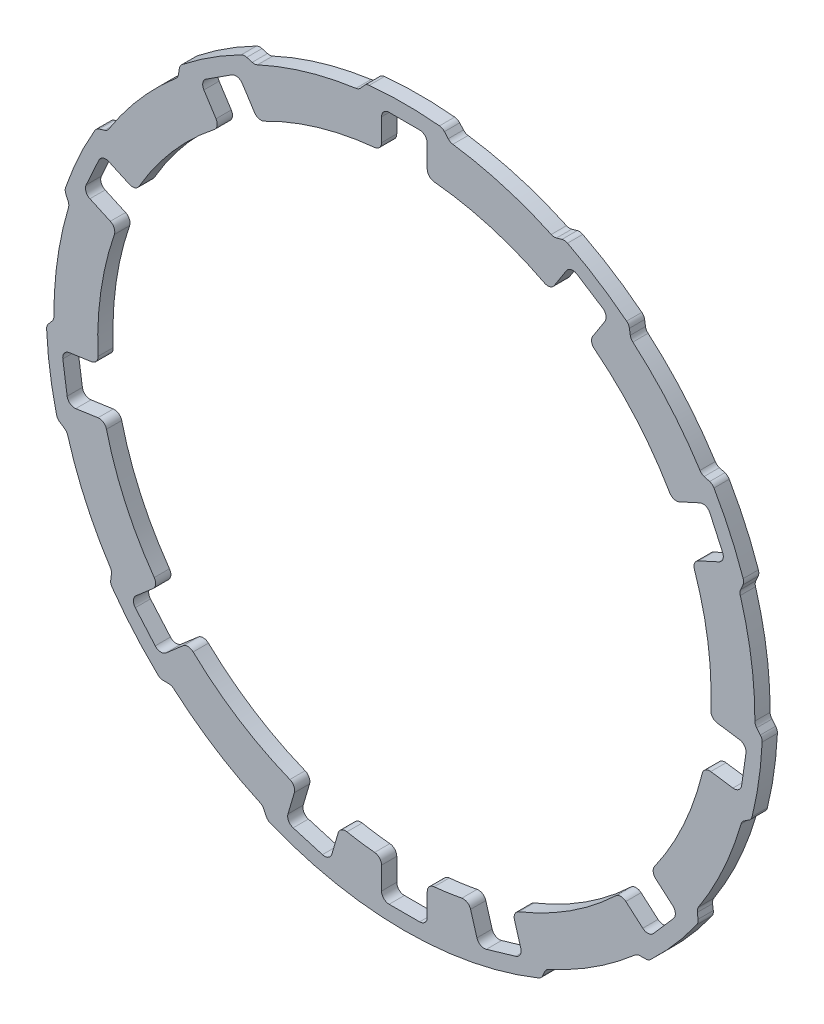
from build123d import *

# Parameters (mm, degrees)
ESQUISSE1_R                        = 46
ESQUISSE1_R_2                      = 40.25
EXTRUSION1_DEPTH                   = 2
EXTRUSION2_DEPTH                   = 2
ESQUISSE3_W                        = 6
ESQUISSE3_H                        = 45
ENL_V_MAT_EXTRU_1_DEPTH            = 66.795136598
CONG_1_R                           = 1
R_P_TITION_CIRCULAIRE1_COUNT       = 11
CONG_1_OF_R_P_TITION_CIRCULAIRE1_R = 1
CONG_2_R                           = 1
EXTRUSION3_DEPTH                   = 2


with BuildPart() as part:
    # Esquisse1 → Extrusion1 (new body)
    with BuildSketch(Plane.XY):
        Circle(ESQUISSE1_R)
        Circle(ESQUISSE1_R_2, mode=Mode.SUBTRACT)
    extrude(amount=EXTRUSION1_DEPTH)

    # Esquisse2 → Extrusion2 (add)
    with BuildSketch(Plane.XY.offset(2)):
        with BuildLine():
            Line((-5, 46.733285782), (-6, 45.607017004))
            Line((-6, 45.607017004), (6, 45.607017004))
            Line((6, 45.607017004), (5, 46.733285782))
            ThreePointArc((5, 46.733285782), (0, 47), (-5, 46.733285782))
        make_face()
    extrusion2 = extrude(amount=-EXTRUSION2_DEPTH)

    # Esquisse3 → Enl_v. mat.-Extru.1 (cut, through all)
    with BuildSketch(Plane.XY.offset(2)):
        with Locations((0, 22.5)):
            Rectangle(ESQUISSE3_W, ESQUISSE3_H)
    enl_v_mat_extru_1 = extrude(amount=-ENL_V_MAT_EXTRU_1_DEPTH, mode=Mode.SUBTRACT)

    # Cong_1
    cong_1_edges = [part.edges().sort_by_distance(p)[0] for p in [
        (-5, 46.733285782, 1),
        (5, 46.733285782, 1),
        (6, 45.607017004, 1),
        (-6, 45.607017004, 1),
        (3, 40.138043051, 1),
        (-3, 40.138043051, 1),
        (-3, 45, 1),
        (3, 45, 1),
    ]]
    fillet(cong_1_edges, radius=CONG_1_R)

    # R_p_tition circulaire1: Extrusion2, Enl_v. mat.-Extru.1 ×11 about axis
    r_p_tition_circulaire1_axis = Axis((0, 0, 0), (0, 0, 1))
    add([extrusion2.rotate(r_p_tition_circulaire1_axis, i * 360 / R_P_TITION_CIRCULAIRE1_COUNT) for i in range(1, R_P_TITION_CIRCULAIRE1_COUNT)])
    add([enl_v_mat_extru_1.rotate(r_p_tition_circulaire1_axis, i * 360 / R_P_TITION_CIRCULAIRE1_COUNT) for i in range(1, R_P_TITION_CIRCULAIRE1_COUNT)], mode=Mode.SUBTRACT)

    # Cong_1 of R_p_tition circulaire1
    cong_1_of_r_p_tition_circulaire1_edges = [part.edges().sort_by_distance(p)[0] for p in [
        (-29.472189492, 36.611337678, 1),
        (-21.059654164, 42.017745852, 1),
        (-19.609493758, 41.610909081, 1),
        (-29.704536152, 35.123219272, 1),
        (-19.176503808, 35.38819297, 1),
        (-24.224025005, 32.144348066, 1),
        (-26.852597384, 36.234486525, 1),
        (-21.805076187, 39.47833143, 1),
        (-44.587167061, 14.865548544, 1),
        (-40.433016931, 23.961868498, 1),
        (-38.993111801, 24.403631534, 1),
        (-43.978091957, 13.48804759, 1),
        (-35.264603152, 19.402841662, 1),
        (-37.75709323, 13.94504969, 1),
        (-42.17968483, 15.964779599, 1),
        (-39.687194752, 21.422571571, 1),
        (-45.546034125, -11.599947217, 1),
        (-46.969182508, -1.701732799, 1),
        (-45.99669236, -0.551626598, 1),
        (-44.288914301, -12.4294839, 1),
        (-40.156440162, -2.74277478, 1),
        (-39.302551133, -8.681703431, 1),
        (-44.11502037, -9.373632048, 1),
        (-44.968909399, -3.434703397, 1),
        (-32.044357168, -34.382541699, 1),
        (-38.592964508, -26.825045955, 1),
        (-38.396648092, -25.331747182, 1),
        (-30.538319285, -34.400742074, 1),
        (-32.298891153, -24.017579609, 1),
        (-28.36972675, -28.552077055, 1),
        (-32.044148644, -31.735981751, 1),
        (-35.973313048, -27.201484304, 1),
        (-8.368823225, -46.248922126, 1),
        (-17.963752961, -43.431596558, 1),
        (-18.605939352, -42.069217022, 1),
        (-7.092023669, -45.450007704, 1),
        (-14.186672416, -37.666972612, 1),
        (-8.429714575, -39.357367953, 1),
        (-9.799486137, -44.022381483, 1),
        (-15.556443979, -42.331986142, 1),
        (17.963752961, -43.431596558, 1),
        (8.368823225, -46.248922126, 1),
        (7.092023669, -45.450007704, 1),
        (18.605939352, -42.069217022, 1),
        (8.429714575, -39.357367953, 1),
        (14.186672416, -37.666972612, 1),
        (15.556443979, -42.331986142, 1),
        (9.799486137, -44.022381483, 1),
        (38.592964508, -26.825045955, 1),
        (32.044357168, -34.382541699, 1),
        (30.538319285, -34.400742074, 1),
        (38.396648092, -25.331747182, 1),
        (28.36972675, -28.552077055, 1),
        (32.298891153, -24.017579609, 1),
        (35.973313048, -27.201484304, 1),
        (32.044148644, -31.735981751, 1),
        (46.969182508, -1.701732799, 1),
        (45.546034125, -11.599947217, 1),
        (44.288914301, -12.4294839, 1),
        (45.99669236, -0.551626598, 1),
        (39.302551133, -8.681703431, 1),
        (40.156440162, -2.74277478, 1),
        (44.968909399, -3.434703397, 1),
        (44.11502037, -9.373632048, 1),
        (40.433016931, 23.961868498, 1),
        (44.587167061, 14.865548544, 1),
        (43.978091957, 13.48804759, 1),
        (38.993111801, 24.403631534, 1),
        (37.75709323, 13.94504969, 1),
        (35.264603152, 19.402841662, 1),
        (39.687194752, 21.422571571, 1),
        (42.17968483, 15.964779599, 1),
        (21.059654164, 42.017745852, 1),
        (29.472189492, 36.611337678, 1),
        (29.704536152, 35.123219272, 1),
        (19.609493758, 41.610909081, 1),
        (24.224025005, 32.144348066, 1),
        (19.176503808, 35.38819297, 1),
        (21.805076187, 39.47833143, 1),
        (26.852597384, 36.234486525, 1),
    ]]
    fillet(cong_1_of_r_p_tition_circulaire1_edges, radius=CONG_1_OF_R_P_TITION_CIRCULAIRE1_R)

    # Sym_trie1: Enl_v. mat.-Extru.1 across plane
    add(enl_v_mat_extru_1.mirror(Plane.ZX), mode=Mode.SUBTRACT)

    # Cong_2
    cong_2_edges = [part.edges().sort_by_distance(p)[0] for p in [
        (-3, -40.138043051, 1),
        (-3, -45, 1),
        (3, -40.138043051, 1),
        (3, -45, 1),
    ]]
    fillet(cong_2_edges, radius=CONG_2_R)

    # Esquisse4 → Extrusion3 (add)
    with BuildSketch(Plane.XY.offset(2)):
        with BuildLine():
            Line((-8.755629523, -46.177255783), (-8.569339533, -45.194760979))
            ThreePointArc((-8.569339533, -45.194760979), (0, -46), (8.569339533, -45.194760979))
            Line((8.569339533, -45.194760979), (8.755629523, -46.177255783))
            ThreePointArc((8.755629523, -46.177255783), (0, -47), (-8.755629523, -46.177255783))
        make_face()
    extrude(amount=-EXTRUSION3_DEPTH)


solid = part.part
